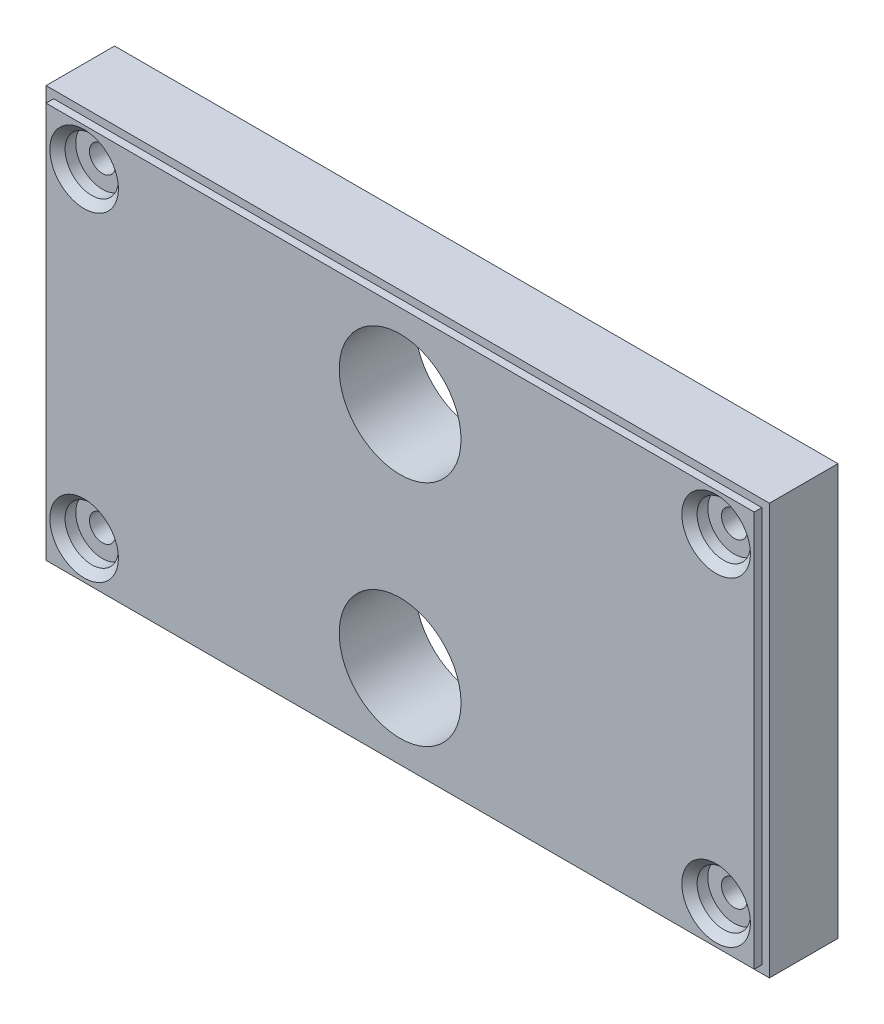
ISO-10303-21;
HEADER;
FILE_DESCRIPTION(('STEP AP214'),'2;1');
FILE_NAME('part.step','',(''),(''),'','','');
FILE_SCHEMA(('AUTOMOTIVE_DESIGN { 1 0 10303 214 1 1 1 1 }'));
ENDSEC;
DATA;
#1=APPLICATION_CONTEXT('core data for automotive mechanical design processes');
#2=APPLICATION_PROTOCOL_DEFINITION('international standard','automotive_design',2000,#1);
#3=PRODUCT_CONTEXT('',#1,'mechanical');
#4=PRODUCT('Part','Part','',(#3));
#5=PRODUCT_RELATED_PRODUCT_CATEGORY('part','',(#4));
#6=PRODUCT_DEFINITION_FORMATION('','',#4);
#7=PRODUCT_DEFINITION_CONTEXT('part definition',#1,'design');
#8=PRODUCT_DEFINITION('design','',#6,#7);
#9=PRODUCT_DEFINITION_SHAPE('','',#8);
#10=(LENGTH_UNIT() NAMED_UNIT(*) SI_UNIT(.MILLI.,.METRE.));
#11=(NAMED_UNIT(*) PLANE_ANGLE_UNIT() SI_UNIT($,.RADIAN.));
#12=(NAMED_UNIT(*) SI_UNIT($,.STERADIAN.) SOLID_ANGLE_UNIT());
#13=UNCERTAINTY_MEASURE_WITH_UNIT(LENGTH_MEASURE(1.E-05),#10,'distance_accuracy_value','');
#14=(GEOMETRIC_REPRESENTATION_CONTEXT(3) GLOBAL_UNCERTAINTY_ASSIGNED_CONTEXT((#13)) GLOBAL_UNIT_ASSIGNED_CONTEXT((#10,
#11,#12)) REPRESENTATION_CONTEXT('',''));
#15=CARTESIAN_POINT('',(0.,0.,0.));
#16=DIRECTION('',(0.,0.,1.));
#17=DIRECTION('',(1.,0.,0.));
#18=AXIS2_PLACEMENT_3D('',#15,#16,#17);
#19=CARTESIAN_POINT('',(-359.85170897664,-27.,119.27488274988));
#20=DIRECTION('',(-1.,0.,0.));
#21=DIRECTION('',(0.,0.,1.));
#22=AXIS2_PLACEMENT_3D('',#19,#20,#21);
#23=PLANE('',#22);
#24=DIRECTION('',(0.,1.,0.));
#25=VECTOR('',#24,1.);
#26=CARTESIAN_POINT('',(-359.85170897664,-27.,8.99999999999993));
#27=LINE('',#26,#25);
#28=CARTESIAN_POINT('',(-359.85170897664,-27.,8.99999999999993));
#29=VERTEX_POINT('',#28);
#30=CARTESIAN_POINT('',(-359.85170897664,27.,8.99999999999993));
#31=VERTEX_POINT('',#30);
#32=EDGE_CURVE('E79',#29,#31,#27,.T.);
#33=ORIENTED_EDGE('',*,*,#32,.F.);
#34=DIRECTION('',(0.,0.,-1.));
#35=VECTOR('',#34,1.);
#36=CARTESIAN_POINT('',(-359.85170897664,-27.,119.27488274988));
#37=LINE('',#36,#35);
#38=CARTESIAN_POINT('',(-359.85170897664,-27.,0.));
#39=VERTEX_POINT('',#38);
#40=EDGE_CURVE('E193',#29,#39,#37,.T.);
#41=ORIENTED_EDGE('',*,*,#40,.T.);
#42=DIRECTION('',(0.,1.,0.));
#43=VECTOR('',#42,1.);
#44=CARTESIAN_POINT('',(-359.85170897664,-27.,0.));
#45=LINE('',#44,#43);
#46=CARTESIAN_POINT('',(-359.85170897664,27.,0.));
#47=VERTEX_POINT('',#46);
#48=EDGE_CURVE('E188',#39,#47,#45,.T.);
#49=ORIENTED_EDGE('',*,*,#48,.T.);
#50=DIRECTION('',(0.,0.,-1.));
#51=VECTOR('',#50,1.);
#52=CARTESIAN_POINT('',(-359.85170897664,27.,119.27488274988));
#53=LINE('',#52,#51);
#54=EDGE_CURVE('E191',#31,#47,#53,.T.);
#55=ORIENTED_EDGE('',*,*,#54,.F.);
#56=EDGE_LOOP('',(#33,#41,#49,#55));
#57=FACE_BOUND('',#56,.T.);
#58=ADVANCED_FACE('F64',(#57),#23,.F.);
#59=CARTESIAN_POINT('',(-454.85170897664,-27.,119.27488274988));
#60=DIRECTION('',(0.,1.,0.));
#61=DIRECTION('',(0.,0.,1.));
#62=AXIS2_PLACEMENT_3D('',#59,#60,#61);
#63=PLANE('',#62);
#64=DIRECTION('',(1.,0.,0.));
#65=VECTOR('',#64,1.);
#66=CARTESIAN_POINT('',(-454.85170897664,-27.,8.99999999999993));
#67=LINE('',#66,#65);
#68=CARTESIAN_POINT('',(-454.85170897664,-27.,8.99999999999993));
#69=VERTEX_POINT('',#68);
#70=EDGE_CURVE('E176',#69,#29,#67,.T.);
#71=ORIENTED_EDGE('',*,*,#70,.F.);
#72=DIRECTION('',(0.,0.,-1.));
#73=VECTOR('',#72,1.);
#74=CARTESIAN_POINT('',(-454.85170897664,-27.,119.27488274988));
#75=LINE('',#74,#73);
#76=CARTESIAN_POINT('',(-454.85170897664,-27.,0.));
#77=VERTEX_POINT('',#76);
#78=EDGE_CURVE('E195',#69,#77,#75,.T.);
#79=ORIENTED_EDGE('',*,*,#78,.T.);
#80=DIRECTION('',(1.,0.,0.));
#81=VECTOR('',#80,1.);
#82=CARTESIAN_POINT('',(-454.85170897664,-27.,0.));
#83=LINE('',#82,#81);
#84=EDGE_CURVE('E185',#77,#39,#83,.T.);
#85=ORIENTED_EDGE('',*,*,#84,.T.);
#86=ORIENTED_EDGE('',*,*,#40,.F.);
#87=EDGE_LOOP('',(#71,#79,#85,#86));
#88=FACE_BOUND('',#87,.T.);
#89=ADVANCED_FACE('F237',(#88),#63,.F.);
#90=CARTESIAN_POINT('',(-454.85170897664,27.,119.27488274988));
#91=DIRECTION('',(1.,0.,0.));
#92=DIRECTION('',(0.,0.,-1.));
#93=AXIS2_PLACEMENT_3D('',#90,#91,#92);
#94=PLANE('',#93);
#95=DIRECTION('',(0.,-1.,0.));
#96=VECTOR('',#95,1.);
#97=CARTESIAN_POINT('',(-454.85170897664,27.,8.99999999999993));
#98=LINE('',#97,#96);
#99=CARTESIAN_POINT('',(-454.85170897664,27.,8.99999999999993));
#100=VERTEX_POINT('',#99);
#101=EDGE_CURVE('E174',#100,#69,#98,.T.);
#102=ORIENTED_EDGE('',*,*,#101,.F.);
#103=DIRECTION('',(0.,0.,-1.));
#104=VECTOR('',#103,1.);
#105=CARTESIAN_POINT('',(-454.85170897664,27.,119.27488274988));
#106=LINE('',#105,#104);
#107=CARTESIAN_POINT('',(-454.85170897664,27.,0.));
#108=VERTEX_POINT('',#107);
#109=EDGE_CURVE('E197',#100,#108,#106,.T.);
#110=ORIENTED_EDGE('',*,*,#109,.T.);
#111=DIRECTION('',(0.,-1.,0.));
#112=VECTOR('',#111,1.);
#113=CARTESIAN_POINT('',(-454.85170897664,27.,0.));
#114=LINE('',#113,#112);
#115=EDGE_CURVE('E182',#108,#77,#114,.T.);
#116=ORIENTED_EDGE('',*,*,#115,.T.);
#117=ORIENTED_EDGE('',*,*,#78,.F.);
#118=EDGE_LOOP('',(#102,#110,#116,#117));
#119=FACE_BOUND('',#118,.T.);
#120=ADVANCED_FACE('F243',(#119),#94,.F.);
#121=CARTESIAN_POINT('',(-359.85170897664,27.,119.27488274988));
#122=DIRECTION('',(0.,-1.,0.));
#123=DIRECTION('',(0.,0.,-1.));
#124=AXIS2_PLACEMENT_3D('',#121,#122,#123);
#125=PLANE('',#124);
#126=DIRECTION('',(-1.,0.,0.));
#127=VECTOR('',#126,1.);
#128=CARTESIAN_POINT('',(-359.85170897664,27.,8.99999999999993));
#129=LINE('',#128,#127);
#130=EDGE_CURVE('E169',#31,#100,#129,.T.);
#131=ORIENTED_EDGE('',*,*,#130,.F.);
#132=ORIENTED_EDGE('',*,*,#54,.T.);
#133=DIRECTION('',(-1.,0.,0.));
#134=VECTOR('',#133,1.);
#135=CARTESIAN_POINT('',(-359.85170897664,27.,0.));
#136=LINE('',#135,#134);
#137=EDGE_CURVE('E179',#47,#108,#136,.T.);
#138=ORIENTED_EDGE('',*,*,#137,.T.);
#139=ORIENTED_EDGE('',*,*,#109,.F.);
#140=EDGE_LOOP('',(#131,#132,#138,#139));
#141=FACE_BOUND('',#140,.T.);
#142=ADVANCED_FACE('F252',(#141),#125,.F.);
#143=CARTESIAN_POINT('',(0.,0.,0.));
#144=DIRECTION('',(0.,0.,1.));
#145=DIRECTION('',(1.,0.,0.));
#146=AXIS2_PLACEMENT_3D('',#143,#144,#145);
#147=PLANE('',#146);
#148=CARTESIAN_POINT('',(-407.35170897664,15.,0.));
#149=DIRECTION('',(0.,0.,1.));
#150=DIRECTION('',(1.,0.,0.));
#151=AXIS2_PLACEMENT_3D('',#148,#149,#150);
#152=CIRCLE('',#151,7.99999999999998);
#153=CARTESIAN_POINT('',(-399.35170897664,15.,0.));
#154=VERTEX_POINT('',#153);
#155=EDGE_CURVE('E338',#154,#154,#152,.T.);
#156=ORIENTED_EDGE('',*,*,#155,.T.);
#157=EDGE_LOOP('',(#156));
#158=FACE_BOUND('',#157,.T.);
#159=CARTESIAN_POINT('',(-407.35170897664,-15.,0.));
#160=DIRECTION('',(0.,0.,1.));
#161=DIRECTION('',(1.,0.,0.));
#162=AXIS2_PLACEMENT_3D('',#159,#160,#161);
#163=CIRCLE('',#162,7.99999999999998);
#164=CARTESIAN_POINT('',(-399.35170897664,-15.,0.));
#165=VERTEX_POINT('',#164);
#166=EDGE_CURVE('E342',#165,#165,#163,.T.);
#167=ORIENTED_EDGE('',*,*,#166,.T.);
#168=EDGE_LOOP('',(#167));
#169=FACE_BOUND('',#168,.T.);
#170=CARTESIAN_POINT('',(-448.85170897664,21.,0.));
#171=DIRECTION('',(0.,0.,1.));
#172=DIRECTION('',(1.,0.,0.));
#173=AXIS2_PLACEMENT_3D('',#170,#171,#172);
#174=CIRCLE('',#173,1.69999999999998);
#175=CARTESIAN_POINT('',(-447.15170897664,21.,0.));
#176=VERTEX_POINT('',#175);
#177=EDGE_CURVE('E346',#176,#176,#174,.T.);
#178=ORIENTED_EDGE('',*,*,#177,.T.);
#179=EDGE_LOOP('',(#178));
#180=FACE_BOUND('',#179,.T.);
#181=CARTESIAN_POINT('',(-365.85170897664,21.,0.));
#182=DIRECTION('',(0.,0.,1.));
#183=DIRECTION('',(1.,0.,0.));
#184=AXIS2_PLACEMENT_3D('',#181,#182,#183);
#185=CIRCLE('',#184,1.69999999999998);
#186=CARTESIAN_POINT('',(-364.15170897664,21.,0.));
#187=VERTEX_POINT('',#186);
#188=EDGE_CURVE('E279',#187,#187,#185,.T.);
#189=ORIENTED_EDGE('',*,*,#188,.T.);
#190=EDGE_LOOP('',(#189));
#191=FACE_BOUND('',#190,.T.);
#192=CARTESIAN_POINT('',(-365.85170897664,-21.,0.));
#193=DIRECTION('',(0.,0.,1.));
#194=DIRECTION('',(1.,0.,0.));
#195=AXIS2_PLACEMENT_3D('',#192,#193,#194);
#196=CIRCLE('',#195,1.69999999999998);
#197=CARTESIAN_POINT('',(-364.15170897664,-21.,0.));
#198=VERTEX_POINT('',#197);
#199=EDGE_CURVE('E282',#198,#198,#196,.T.);
#200=ORIENTED_EDGE('',*,*,#199,.T.);
#201=EDGE_LOOP('',(#200));
#202=FACE_BOUND('',#201,.T.);
#203=CARTESIAN_POINT('',(-448.85170897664,-21.,0.));
#204=DIRECTION('',(0.,0.,1.));
#205=DIRECTION('',(1.,0.,0.));
#206=AXIS2_PLACEMENT_3D('',#203,#204,#205);
#207=CIRCLE('',#206,1.69999999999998);
#208=CARTESIAN_POINT('',(-447.15170897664,-21.,0.));
#209=VERTEX_POINT('',#208);
#210=EDGE_CURVE('E159',#209,#209,#207,.T.);
#211=ORIENTED_EDGE('',*,*,#210,.T.);
#212=EDGE_LOOP('',(#211));
#213=FACE_BOUND('',#212,.T.);
#214=ORIENTED_EDGE('',*,*,#137,.F.);
#215=ORIENTED_EDGE('',*,*,#48,.F.);
#216=ORIENTED_EDGE('',*,*,#84,.F.);
#217=ORIENTED_EDGE('',*,*,#115,.F.);
#218=EDGE_LOOP('',(#214,#215,#216,#217));
#219=FACE_BOUND('',#218,.T.);
#220=ADVANCED_FACE('F247',(#158,#169,#180,#191,#202,#213,#219),#147,.F.);
#221=CARTESIAN_POINT('',(0.,0.,8.99999999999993));
#222=DIRECTION('',(0.,0.,1.));
#223=DIRECTION('',(1.,0.,0.));
#224=AXIS2_PLACEMENT_3D('',#221,#222,#223);
#225=PLANE('',#224);
#226=DIRECTION('',(0.,1.,0.));
#227=VECTOR('',#226,1.);
#228=CARTESIAN_POINT('',(-360.85170897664,-26.,8.99999999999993));
#229=LINE('',#228,#227);
#230=CARTESIAN_POINT('',(-360.85170897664,-26.,8.99999999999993));
#231=VERTEX_POINT('',#230);
#232=CARTESIAN_POINT('',(-360.85170897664,26.,8.99999999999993));
#233=VERTEX_POINT('',#232);
#234=EDGE_CURVE('E141',#231,#233,#229,.T.);
#235=ORIENTED_EDGE('',*,*,#234,.F.);
#236=DIRECTION('',(1.,0.,0.));
#237=VECTOR('',#236,1.);
#238=CARTESIAN_POINT('',(-453.85170897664,-26.,8.99999999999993));
#239=LINE('',#238,#237);
#240=CARTESIAN_POINT('',(-453.85170897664,-26.,8.99999999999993));
#241=VERTEX_POINT('',#240);
#242=EDGE_CURVE('E150',#241,#231,#239,.T.);
#243=ORIENTED_EDGE('',*,*,#242,.F.);
#244=DIRECTION('',(0.,-1.,0.));
#245=VECTOR('',#244,1.);
#246=CARTESIAN_POINT('',(-453.85170897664,26.,8.99999999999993));
#247=LINE('',#246,#245);
#248=CARTESIAN_POINT('',(-453.85170897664,26.,8.99999999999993));
#249=VERTEX_POINT('',#248);
#250=EDGE_CURVE('E133',#249,#241,#247,.T.);
#251=ORIENTED_EDGE('',*,*,#250,.F.);
#252=DIRECTION('',(-1.,0.,0.));
#253=VECTOR('',#252,1.);
#254=CARTESIAN_POINT('',(-360.85170897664,26.,8.99999999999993));
#255=LINE('',#254,#253);
#256=EDGE_CURVE('E147',#233,#249,#255,.T.);
#257=ORIENTED_EDGE('',*,*,#256,.F.);
#258=EDGE_LOOP('',(#235,#243,#251,#257));
#259=FACE_BOUND('',#258,.T.);
#260=ORIENTED_EDGE('',*,*,#130,.T.);
#261=ORIENTED_EDGE('',*,*,#101,.T.);
#262=ORIENTED_EDGE('',*,*,#70,.T.);
#263=ORIENTED_EDGE('',*,*,#32,.T.);
#264=EDGE_LOOP('',(#260,#261,#262,#263));
#265=FACE_BOUND('',#264,.T.);
#266=ADVANCED_FACE('F146',(#259,#265),#225,.T.);
#267=CARTESIAN_POINT('',(-360.85170897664,26.,8.99999999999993));
#268=DIRECTION('',(0.,1.,0.));
#269=DIRECTION('',(0.,0.,1.));
#270=AXIS2_PLACEMENT_3D('',#267,#268,#269);
#271=PLANE('',#270);
#272=DIRECTION('',(-1.,0.,0.));
#273=VECTOR('',#272,1.);
#274=CARTESIAN_POINT('',(-360.85170897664,26.,9.99999999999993));
#275=LINE('',#274,#273);
#276=CARTESIAN_POINT('',(-360.85170897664,26.,9.99999999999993));
#277=VERTEX_POINT('',#276);
#278=CARTESIAN_POINT('',(-453.85170897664,26.,9.99999999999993));
#279=VERTEX_POINT('',#278);
#280=EDGE_CURVE('E164',#277,#279,#275,.T.);
#281=ORIENTED_EDGE('',*,*,#280,.F.);
#282=DIRECTION('',(0.,0.,1.));
#283=VECTOR('',#282,1.);
#284=CARTESIAN_POINT('',(-360.85170897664,26.,8.99999999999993));
#285=LINE('',#284,#283);
#286=EDGE_CURVE('E153',#233,#277,#285,.T.);
#287=ORIENTED_EDGE('',*,*,#286,.F.);
#288=ORIENTED_EDGE('',*,*,#256,.T.);
#289=DIRECTION('',(0.,0.,1.));
#290=VECTOR('',#289,1.);
#291=CARTESIAN_POINT('',(-453.85170897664,26.,8.99999999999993));
#292=LINE('',#291,#290);
#293=EDGE_CURVE('E130',#249,#279,#292,.T.);
#294=ORIENTED_EDGE('',*,*,#293,.T.);
#295=EDGE_LOOP('',(#281,#287,#288,#294));
#296=FACE_BOUND('',#295,.T.);
#297=ADVANCED_FACE('F152',(#296),#271,.T.);
#298=CARTESIAN_POINT('',(-360.85170897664,-26.,8.99999999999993));
#299=DIRECTION('',(1.,0.,0.));
#300=DIRECTION('',(0.,0.,-1.));
#301=AXIS2_PLACEMENT_3D('',#298,#299,#300);
#302=PLANE('',#301);
#303=DIRECTION('',(0.,1.,0.));
#304=VECTOR('',#303,1.);
#305=CARTESIAN_POINT('',(-360.85170897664,-26.,9.99999999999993));
#306=LINE('',#305,#304);
#307=CARTESIAN_POINT('',(-360.85170897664,-26.,9.99999999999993));
#308=VERTEX_POINT('',#307);
#309=EDGE_CURVE('E154',#308,#277,#306,.T.);
#310=ORIENTED_EDGE('',*,*,#309,.F.);
#311=DIRECTION('',(0.,0.,1.));
#312=VECTOR('',#311,1.);
#313=CARTESIAN_POINT('',(-360.85170897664,-26.,8.99999999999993));
#314=LINE('',#313,#312);
#315=EDGE_CURVE('E170',#231,#308,#314,.T.);
#316=ORIENTED_EDGE('',*,*,#315,.F.);
#317=ORIENTED_EDGE('',*,*,#234,.T.);
#318=ORIENTED_EDGE('',*,*,#286,.T.);
#319=EDGE_LOOP('',(#310,#316,#317,#318));
#320=FACE_BOUND('',#319,.T.);
#321=ADVANCED_FACE('F317',(#320),#302,.T.);
#322=CARTESIAN_POINT('',(-453.85170897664,-26.,8.99999999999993));
#323=DIRECTION('',(0.,-1.,0.));
#324=DIRECTION('',(0.,0.,-1.));
#325=AXIS2_PLACEMENT_3D('',#322,#323,#324);
#326=PLANE('',#325);
#327=DIRECTION('',(1.,0.,0.));
#328=VECTOR('',#327,1.);
#329=CARTESIAN_POINT('',(-453.85170897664,-26.,9.99999999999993));
#330=LINE('',#329,#328);
#331=CARTESIAN_POINT('',(-453.85170897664,-26.,10.0000000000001));
#332=VERTEX_POINT('',#331);
#333=EDGE_CURVE('E87',#332,#308,#330,.T.);
#334=ORIENTED_EDGE('',*,*,#333,.F.);
#335=DIRECTION('',(0.,0.,1.));
#336=VECTOR('',#335,1.);
#337=CARTESIAN_POINT('',(-453.85170897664,-26.,8.99999999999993));
#338=LINE('',#337,#336);
#339=EDGE_CURVE('E140',#241,#332,#338,.T.);
#340=ORIENTED_EDGE('',*,*,#339,.F.);
#341=ORIENTED_EDGE('',*,*,#242,.T.);
#342=ORIENTED_EDGE('',*,*,#315,.T.);
#343=EDGE_LOOP('',(#334,#340,#341,#342));
#344=FACE_BOUND('',#343,.T.);
#345=ADVANCED_FACE('F320',(#344),#326,.T.);
#346=CARTESIAN_POINT('',(-453.85170897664,26.,8.99999999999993));
#347=DIRECTION('',(-1.,0.,0.));
#348=DIRECTION('',(0.,0.,1.));
#349=AXIS2_PLACEMENT_3D('',#346,#347,#348);
#350=PLANE('',#349);
#351=DIRECTION('',(0.,-1.,0.));
#352=VECTOR('',#351,1.);
#353=CARTESIAN_POINT('',(-453.85170897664,26.,9.99999999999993));
#354=LINE('',#353,#352);
#355=EDGE_CURVE('E135',#279,#332,#354,.T.);
#356=ORIENTED_EDGE('',*,*,#355,.F.);
#357=ORIENTED_EDGE('',*,*,#293,.F.);
#358=ORIENTED_EDGE('',*,*,#250,.T.);
#359=ORIENTED_EDGE('',*,*,#339,.T.);
#360=EDGE_LOOP('',(#356,#357,#358,#359));
#361=FACE_BOUND('',#360,.T.);
#362=ADVANCED_FACE('F132',(#361),#350,.T.);
#363=CARTESIAN_POINT('',(-349.851708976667,-50.,10.0000000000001));
#364=DIRECTION('',(0.,0.,-1.));
#365=DIRECTION('',(1.,0.,0.));
#366=AXIS2_PLACEMENT_3D('',#363,#364,#365);
#367=PLANE('',#366);
#368=CARTESIAN_POINT('',(-407.35170897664,15.,9.99999999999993));
#369=DIRECTION('',(0.,0.,1.));
#370=DIRECTION('',(1.,0.,0.));
#371=AXIS2_PLACEMENT_3D('',#368,#369,#370);
#372=CIRCLE('',#371,7.99999999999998);
#373=CARTESIAN_POINT('',(-399.35170897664,15.,9.99999999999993));
#374=VERTEX_POINT('',#373);
#375=EDGE_CURVE('E511',#374,#374,#372,.T.);
#376=ORIENTED_EDGE('',*,*,#375,.F.);
#377=EDGE_LOOP('',(#376));
#378=FACE_BOUND('',#377,.T.);
#379=CARTESIAN_POINT('',(-407.35170897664,-15.,9.99999999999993));
#380=DIRECTION('',(0.,0.,1.));
#381=DIRECTION('',(1.,0.,0.));
#382=AXIS2_PLACEMENT_3D('',#379,#380,#381);
#383=CIRCLE('',#382,7.99999999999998);
#384=CARTESIAN_POINT('',(-399.35170897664,-15.,9.99999999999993));
#385=VERTEX_POINT('',#384);
#386=EDGE_CURVE('E507',#385,#385,#383,.T.);
#387=ORIENTED_EDGE('',*,*,#386,.F.);
#388=EDGE_LOOP('',(#387));
#389=FACE_BOUND('',#388,.T.);
#390=CARTESIAN_POINT('',(-365.85170897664,-21.,10.0000000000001));
#391=DIRECTION('',(0.,0.,-1.));
#392=DIRECTION('',(-1.,0.,0.));
#393=AXIS2_PLACEMENT_3D('',#390,#391,#392);
#394=CIRCLE('',#393,4.50000000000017);
#395=CARTESIAN_POINT('',(-370.351708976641,-21.,10.0000000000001));
#396=VERTEX_POINT('',#395);
#397=EDGE_CURVE('E211',#396,#396,#394,.T.);
#398=ORIENTED_EDGE('',*,*,#397,.T.);
#399=EDGE_LOOP('',(#398));
#400=FACE_BOUND('',#399,.T.);
#401=CARTESIAN_POINT('',(-365.85170897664,21.,10.0000000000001));
#402=DIRECTION('',(0.,0.,-1.));
#403=DIRECTION('',(-1.,0.,0.));
#404=AXIS2_PLACEMENT_3D('',#401,#402,#403);
#405=CIRCLE('',#404,4.50000000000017);
#406=CARTESIAN_POINT('',(-370.351708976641,21.,10.0000000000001));
#407=VERTEX_POINT('',#406);
#408=EDGE_CURVE('E208',#407,#407,#405,.T.);
#409=ORIENTED_EDGE('',*,*,#408,.T.);
#410=EDGE_LOOP('',(#409));
#411=FACE_BOUND('',#410,.T.);
#412=CARTESIAN_POINT('',(-448.85170897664,21.,10.0000000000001));
#413=DIRECTION('',(0.,0.,-1.));
#414=DIRECTION('',(-1.,0.,0.));
#415=AXIS2_PLACEMENT_3D('',#412,#413,#414);
#416=CIRCLE('',#415,4.50000000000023);
#417=CARTESIAN_POINT('',(-453.351708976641,21.,10.0000000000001));
#418=VERTEX_POINT('',#417);
#419=EDGE_CURVE('E205',#418,#418,#416,.T.);
#420=ORIENTED_EDGE('',*,*,#419,.T.);
#421=EDGE_LOOP('',(#420));
#422=FACE_BOUND('',#421,.T.);
#423=CARTESIAN_POINT('',(-448.85170897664,-21.,10.0000000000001));
#424=DIRECTION('',(0.,0.,-1.));
#425=DIRECTION('',(-1.,0.,0.));
#426=AXIS2_PLACEMENT_3D('',#423,#424,#425);
#427=CIRCLE('',#426,4.50000000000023);
#428=CARTESIAN_POINT('',(-453.351708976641,-21.,10.0000000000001));
#429=VERTEX_POINT('',#428);
#430=EDGE_CURVE('E202',#429,#429,#427,.T.);
#431=ORIENTED_EDGE('',*,*,#430,.T.);
#432=EDGE_LOOP('',(#431));
#433=FACE_BOUND('',#432,.T.);
#434=ORIENTED_EDGE('',*,*,#280,.T.);
#435=ORIENTED_EDGE('',*,*,#355,.T.);
#436=ORIENTED_EDGE('',*,*,#333,.T.);
#437=ORIENTED_EDGE('',*,*,#309,.T.);
#438=EDGE_LOOP('',(#434,#435,#436,#437));
#439=FACE_BOUND('',#438,.T.);
#440=ADVANCED_FACE('F305',(#378,#389,#400,#411,#422,#433,#439),#367,.F.);
#441=CARTESIAN_POINT('',(-448.85170897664,-21.,9.99999999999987));
#442=DIRECTION('',(0.,0.,1.));
#443=DIRECTION('',(1.,0.,0.));
#444=AXIS2_PLACEMENT_3D('',#441,#442,#443);
#445=CYLINDRICAL_SURFACE('',#444,1.69999999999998);
#446=ORIENTED_EDGE('',*,*,#210,.F.);
#447=EDGE_LOOP('',(#446));
#448=FACE_BOUND('',#447,.T.);
#449=CARTESIAN_POINT('',(-448.85170897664,-21.,7.59999999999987));
#450=DIRECTION('',(0.,0.,1.));
#451=DIRECTION('',(1.,0.,0.));
#452=AXIS2_PLACEMENT_3D('',#449,#450,#451);
#453=CIRCLE('',#452,1.69999999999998);
#454=CARTESIAN_POINT('',(-447.15170897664,-21.,7.59999999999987));
#455=VERTEX_POINT('',#454);
#456=EDGE_CURVE('E293',#455,#455,#453,.T.);
#457=ORIENTED_EDGE('',*,*,#456,.T.);
#458=EDGE_LOOP('',(#457));
#459=FACE_BOUND('',#458,.T.);
#460=ADVANCED_FACE('F302',(#448,#459),#445,.F.);
#461=CARTESIAN_POINT('',(-447.15170897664,-21.,7.59999999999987));
#462=DIRECTION('',(0.,0.,-1.));
#463=DIRECTION('',(-1.,0.,0.));
#464=AXIS2_PLACEMENT_3D('',#461,#462,#463);
#465=PLANE('',#464);
#466=ORIENTED_EDGE('',*,*,#456,.F.);
#467=EDGE_LOOP('',(#466));
#468=FACE_BOUND('',#467,.T.);
#469=CARTESIAN_POINT('',(-448.85170897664,-21.,7.59999999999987));
#470=DIRECTION('',(0.,0.,1.));
#471=DIRECTION('',(1.,0.,0.));
#472=AXIS2_PLACEMENT_3D('',#469,#470,#471);
#473=CIRCLE('',#472,3.5);
#474=CARTESIAN_POINT('',(-445.35170897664,-21.,7.59999999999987));
#475=VERTEX_POINT('',#474);
#476=EDGE_CURVE('E291',#475,#475,#473,.T.);
#477=ORIENTED_EDGE('',*,*,#476,.T.);
#478=EDGE_LOOP('',(#477));
#479=FACE_BOUND('',#478,.T.);
#480=ADVANCED_FACE('F304',(#468,#479),#465,.F.);
#481=CARTESIAN_POINT('',(-448.85170897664,-21.,9.99999999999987));
#482=DIRECTION('',(0.,0.,1.));
#483=DIRECTION('',(1.,0.,0.));
#484=AXIS2_PLACEMENT_3D('',#481,#482,#483);
#485=CYLINDRICAL_SURFACE('',#484,3.5);
#486=CARTESIAN_POINT('',(-448.85170897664,-21.,8.9999999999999));
#487=DIRECTION('',(0.,0.,-1.));
#488=DIRECTION('',(-1.,0.,0.));
#489=AXIS2_PLACEMENT_3D('',#486,#487,#488);
#490=CIRCLE('',#489,3.5);
#491=CARTESIAN_POINT('',(-452.35170897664,-21.,8.9999999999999));
#492=VERTEX_POINT('',#491);
#493=EDGE_CURVE('E12',#492,#492,#490,.F.);
#494=ORIENTED_EDGE('',*,*,#493,.T.);
#495=EDGE_LOOP('',(#494));
#496=FACE_BOUND('',#495,.T.);
#497=ORIENTED_EDGE('',*,*,#476,.F.);
#498=EDGE_LOOP('',(#497));
#499=FACE_BOUND('',#498,.T.);
#500=ADVANCED_FACE('F311',(#496,#499),#485,.F.);
#501=CARTESIAN_POINT('',(-365.85170897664,-21.,9.99999999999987));
#502=DIRECTION('',(0.,0.,1.));
#503=DIRECTION('',(1.,0.,0.));
#504=AXIS2_PLACEMENT_3D('',#501,#502,#503);
#505=CYLINDRICAL_SURFACE('',#504,1.69999999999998);
#506=ORIENTED_EDGE('',*,*,#199,.F.);
#507=EDGE_LOOP('',(#506));
#508=FACE_BOUND('',#507,.T.);
#509=CARTESIAN_POINT('',(-365.85170897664,-21.,7.59999999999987));
#510=DIRECTION('',(0.,0.,1.));
#511=DIRECTION('',(1.,0.,0.));
#512=AXIS2_PLACEMENT_3D('',#509,#510,#511);
#513=CIRCLE('',#512,1.69999999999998);
#514=CARTESIAN_POINT('',(-364.15170897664,-21.,7.59999999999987));
#515=VERTEX_POINT('',#514);
#516=EDGE_CURVE('E278',#515,#515,#513,.T.);
#517=ORIENTED_EDGE('',*,*,#516,.T.);
#518=EDGE_LOOP('',(#517));
#519=FACE_BOUND('',#518,.T.);
#520=ADVANCED_FACE('F351',(#508,#519),#505,.F.);
#521=CARTESIAN_POINT('',(-364.15170897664,-21.,7.59999999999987));
#522=DIRECTION('',(0.,0.,-1.));
#523=DIRECTION('',(-1.,0.,0.));
#524=AXIS2_PLACEMENT_3D('',#521,#522,#523);
#525=PLANE('',#524);
#526=ORIENTED_EDGE('',*,*,#516,.F.);
#527=EDGE_LOOP('',(#526));
#528=FACE_BOUND('',#527,.T.);
#529=CARTESIAN_POINT('',(-365.85170897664,-21.,7.59999999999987));
#530=DIRECTION('',(0.,0.,1.));
#531=DIRECTION('',(1.,0.,0.));
#532=AXIS2_PLACEMENT_3D('',#529,#530,#531);
#533=CIRCLE('',#532,3.5);
#534=CARTESIAN_POINT('',(-362.35170897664,-21.,7.59999999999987));
#535=VERTEX_POINT('',#534);
#536=EDGE_CURVE('E276',#535,#535,#533,.T.);
#537=ORIENTED_EDGE('',*,*,#536,.T.);
#538=EDGE_LOOP('',(#537));
#539=FACE_BOUND('',#538,.T.);
#540=ADVANCED_FACE('F272',(#528,#539),#525,.F.);
#541=CARTESIAN_POINT('',(-365.85170897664,-21.,9.99999999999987));
#542=DIRECTION('',(0.,0.,1.));
#543=DIRECTION('',(1.,0.,0.));
#544=AXIS2_PLACEMENT_3D('',#541,#542,#543);
#545=CYLINDRICAL_SURFACE('',#544,3.5);
#546=CARTESIAN_POINT('',(-365.85170897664,-21.,8.99999999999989));
#547=DIRECTION('',(0.,0.,-1.));
#548=DIRECTION('',(-1.,0.,0.));
#549=AXIS2_PLACEMENT_3D('',#546,#547,#548);
#550=CIRCLE('',#549,3.5);
#551=CARTESIAN_POINT('',(-369.35170897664,-21.,8.99999999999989));
#552=VERTEX_POINT('',#551);
#553=EDGE_CURVE('E199',#552,#552,#550,.F.);
#554=ORIENTED_EDGE('',*,*,#553,.T.);
#555=EDGE_LOOP('',(#554));
#556=FACE_BOUND('',#555,.T.);
#557=ORIENTED_EDGE('',*,*,#536,.F.);
#558=EDGE_LOOP('',(#557));
#559=FACE_BOUND('',#558,.T.);
#560=ADVANCED_FACE('F268',(#556,#559),#545,.F.);
#561=CARTESIAN_POINT('',(-365.85170897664,21.,9.99999999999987));
#562=DIRECTION('',(0.,0.,1.));
#563=DIRECTION('',(1.,0.,0.));
#564=AXIS2_PLACEMENT_3D('',#561,#562,#563);
#565=CYLINDRICAL_SURFACE('',#564,1.69999999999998);
#566=ORIENTED_EDGE('',*,*,#188,.F.);
#567=EDGE_LOOP('',(#566));
#568=FACE_BOUND('',#567,.T.);
#569=CARTESIAN_POINT('',(-365.85170897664,21.,7.59999999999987));
#570=DIRECTION('',(0.,0.,1.));
#571=DIRECTION('',(1.,0.,0.));
#572=AXIS2_PLACEMENT_3D('',#569,#570,#571);
#573=CIRCLE('',#572,1.69999999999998);
#574=CARTESIAN_POINT('',(-364.15170897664,21.,7.59999999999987));
#575=VERTEX_POINT('',#574);
#576=EDGE_CURVE('E285',#575,#575,#573,.T.);
#577=ORIENTED_EDGE('',*,*,#576,.T.);
#578=EDGE_LOOP('',(#577));
#579=FACE_BOUND('',#578,.T.);
#580=ADVANCED_FACE('F271',(#568,#579),#565,.F.);
#581=CARTESIAN_POINT('',(-364.15170897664,21.,7.59999999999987));
#582=DIRECTION('',(0.,0.,-1.));
#583=DIRECTION('',(-1.,0.,0.));
#584=AXIS2_PLACEMENT_3D('',#581,#582,#583);
#585=PLANE('',#584);
#586=ORIENTED_EDGE('',*,*,#576,.F.);
#587=EDGE_LOOP('',(#586));
#588=FACE_BOUND('',#587,.T.);
#589=CARTESIAN_POINT('',(-365.85170897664,21.,7.59999999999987));
#590=DIRECTION('',(0.,0.,1.));
#591=DIRECTION('',(1.,0.,0.));
#592=AXIS2_PLACEMENT_3D('',#589,#590,#591);
#593=CIRCLE('',#592,3.5);
#594=CARTESIAN_POINT('',(-362.35170897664,21.,7.59999999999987));
#595=VERTEX_POINT('',#594);
#596=EDGE_CURVE('E495',#595,#595,#593,.T.);
#597=ORIENTED_EDGE('',*,*,#596,.T.);
#598=EDGE_LOOP('',(#597));
#599=FACE_BOUND('',#598,.T.);
#600=ADVANCED_FACE('F395',(#588,#599),#585,.F.);
#601=CARTESIAN_POINT('',(-365.85170897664,21.,9.99999999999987));
#602=DIRECTION('',(0.,0.,1.));
#603=DIRECTION('',(1.,0.,0.));
#604=AXIS2_PLACEMENT_3D('',#601,#602,#603);
#605=CYLINDRICAL_SURFACE('',#604,3.5);
#606=CARTESIAN_POINT('',(-365.85170897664,21.,8.99999999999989));
#607=DIRECTION('',(0.,0.,-1.));
#608=DIRECTION('',(-1.,0.,0.));
#609=AXIS2_PLACEMENT_3D('',#606,#607,#608);
#610=CIRCLE('',#609,3.5);
#611=CARTESIAN_POINT('',(-369.35170897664,21.,8.99999999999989));
#612=VERTEX_POINT('',#611);
#613=EDGE_CURVE('E214',#612,#612,#610,.F.);
#614=ORIENTED_EDGE('',*,*,#613,.T.);
#615=EDGE_LOOP('',(#614));
#616=FACE_BOUND('',#615,.T.);
#617=ORIENTED_EDGE('',*,*,#596,.F.);
#618=EDGE_LOOP('',(#617));
#619=FACE_BOUND('',#618,.T.);
#620=ADVANCED_FACE('F404',(#616,#619),#605,.F.);
#621=CARTESIAN_POINT('',(-448.85170897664,21.,9.99999999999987));
#622=DIRECTION('',(0.,0.,1.));
#623=DIRECTION('',(1.,0.,0.));
#624=AXIS2_PLACEMENT_3D('',#621,#622,#623);
#625=CYLINDRICAL_SURFACE('',#624,1.69999999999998);
#626=ORIENTED_EDGE('',*,*,#177,.F.);
#627=EDGE_LOOP('',(#626));
#628=FACE_BOUND('',#627,.T.);
#629=CARTESIAN_POINT('',(-448.85170897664,21.,7.59999999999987));
#630=DIRECTION('',(0.,0.,1.));
#631=DIRECTION('',(1.,0.,0.));
#632=AXIS2_PLACEMENT_3D('',#629,#630,#631);
#633=CIRCLE('',#632,1.69999999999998);
#634=CARTESIAN_POINT('',(-447.15170897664,21.,7.59999999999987));
#635=VERTEX_POINT('',#634);
#636=EDGE_CURVE('E499',#635,#635,#633,.T.);
#637=ORIENTED_EDGE('',*,*,#636,.T.);
#638=EDGE_LOOP('',(#637));
#639=FACE_BOUND('',#638,.T.);
#640=ADVANCED_FACE('F412',(#628,#639),#625,.F.);
#641=CARTESIAN_POINT('',(-447.15170897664,21.,7.59999999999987));
#642=DIRECTION('',(0.,0.,-1.));
#643=DIRECTION('',(-1.,0.,0.));
#644=AXIS2_PLACEMENT_3D('',#641,#642,#643);
#645=PLANE('',#644);
#646=ORIENTED_EDGE('',*,*,#636,.F.);
#647=EDGE_LOOP('',(#646));
#648=FACE_BOUND('',#647,.T.);
#649=CARTESIAN_POINT('',(-448.85170897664,21.,7.59999999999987));
#650=DIRECTION('',(0.,0.,1.));
#651=DIRECTION('',(1.,0.,0.));
#652=AXIS2_PLACEMENT_3D('',#649,#650,#651);
#653=CIRCLE('',#652,3.5);
#654=CARTESIAN_POINT('',(-445.35170897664,21.,7.59999999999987));
#655=VERTEX_POINT('',#654);
#656=EDGE_CURVE('E504',#655,#655,#653,.T.);
#657=ORIENTED_EDGE('',*,*,#656,.T.);
#658=EDGE_LOOP('',(#657));
#659=FACE_BOUND('',#658,.T.);
#660=ADVANCED_FACE('F262',(#648,#659),#645,.F.);
#661=CARTESIAN_POINT('',(-448.85170897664,21.,9.99999999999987));
#662=DIRECTION('',(0.,0.,1.));
#663=DIRECTION('',(1.,0.,0.));
#664=AXIS2_PLACEMENT_3D('',#661,#662,#663);
#665=CYLINDRICAL_SURFACE('',#664,3.5);
#666=CARTESIAN_POINT('',(-448.85170897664,21.,8.9999999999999));
#667=DIRECTION('',(0.,0.,-1.));
#668=DIRECTION('',(-1.,0.,0.));
#669=AXIS2_PLACEMENT_3D('',#666,#667,#668);
#670=CIRCLE('',#669,3.5);
#671=CARTESIAN_POINT('',(-452.35170897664,21.,8.9999999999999));
#672=VERTEX_POINT('',#671);
#673=EDGE_CURVE('E72',#672,#672,#670,.F.);
#674=ORIENTED_EDGE('',*,*,#673,.T.);
#675=EDGE_LOOP('',(#674));
#676=FACE_BOUND('',#675,.T.);
#677=ORIENTED_EDGE('',*,*,#656,.F.);
#678=EDGE_LOOP('',(#677));
#679=FACE_BOUND('',#678,.T.);
#680=ADVANCED_FACE('F219',(#676,#679),#665,.F.);
#681=CARTESIAN_POINT('',(-365.85170897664,-21.,8.99999999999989));
#682=DIRECTION('',(0.,0.,1.));
#683=DIRECTION('',(1.,0.,0.));
#684=AXIS2_PLACEMENT_3D('',#681,#682,#683);
#685=CONICAL_SURFACE('',#684,3.5,0.785398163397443);
#686=ORIENTED_EDGE('',*,*,#397,.F.);
#687=EDGE_LOOP('',(#686));
#688=FACE_BOUND('',#687,.T.);
#689=ORIENTED_EDGE('',*,*,#553,.F.);
#690=EDGE_LOOP('',(#689));
#691=FACE_BOUND('',#690,.T.);
#692=ADVANCED_FACE('F232',(#688,#691),#685,.F.);
#693=CARTESIAN_POINT('',(-365.85170897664,21.,8.99999999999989));
#694=DIRECTION('',(0.,0.,1.));
#695=DIRECTION('',(1.,0.,0.));
#696=AXIS2_PLACEMENT_3D('',#693,#694,#695);
#697=CONICAL_SURFACE('',#696,3.5,0.785398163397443);
#698=ORIENTED_EDGE('',*,*,#408,.F.);
#699=EDGE_LOOP('',(#698));
#700=FACE_BOUND('',#699,.T.);
#701=ORIENTED_EDGE('',*,*,#613,.F.);
#702=EDGE_LOOP('',(#701));
#703=FACE_BOUND('',#702,.T.);
#704=ADVANCED_FACE('F224',(#700,#703),#697,.F.);
#705=CARTESIAN_POINT('',(-448.85170897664,21.,8.9999999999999));
#706=DIRECTION('',(0.,0.,1.));
#707=DIRECTION('',(1.,0.,0.));
#708=AXIS2_PLACEMENT_3D('',#705,#706,#707);
#709=CONICAL_SURFACE('',#708,3.5,0.785398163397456);
#710=ORIENTED_EDGE('',*,*,#419,.F.);
#711=EDGE_LOOP('',(#710));
#712=FACE_BOUND('',#711,.T.);
#713=ORIENTED_EDGE('',*,*,#673,.F.);
#714=EDGE_LOOP('',(#713));
#715=FACE_BOUND('',#714,.T.);
#716=ADVANCED_FACE('F222',(#712,#715),#709,.F.);
#717=CARTESIAN_POINT('',(-448.85170897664,-21.,8.9999999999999));
#718=DIRECTION('',(0.,0.,1.));
#719=DIRECTION('',(1.,0.,0.));
#720=AXIS2_PLACEMENT_3D('',#717,#718,#719);
#721=CONICAL_SURFACE('',#720,3.5,0.785398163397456);
#722=ORIENTED_EDGE('',*,*,#430,.F.);
#723=EDGE_LOOP('',(#722));
#724=FACE_BOUND('',#723,.T.);
#725=ORIENTED_EDGE('',*,*,#493,.F.);
#726=EDGE_LOOP('',(#725));
#727=FACE_BOUND('',#726,.T.);
#728=ADVANCED_FACE('F66',(#724,#727),#721,.F.);
#729=CARTESIAN_POINT('',(-407.35170897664,-15.,0.));
#730=DIRECTION('',(0.,0.,1.));
#731=DIRECTION('',(1.,0.,0.));
#732=AXIS2_PLACEMENT_3D('',#729,#730,#731);
#733=CYLINDRICAL_SURFACE('',#732,7.99999999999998);
#734=ORIENTED_EDGE('',*,*,#166,.F.);
#735=EDGE_LOOP('',(#734));
#736=FACE_BOUND('',#735,.T.);
#737=ORIENTED_EDGE('',*,*,#386,.T.);
#738=EDGE_LOOP('',(#737));
#739=FACE_BOUND('',#738,.T.);
#740=ADVANCED_FACE('F230',(#736,#739),#733,.F.);
#741=CARTESIAN_POINT('',(-407.35170897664,15.,0.));
#742=DIRECTION('',(0.,0.,1.));
#743=DIRECTION('',(1.,0.,0.));
#744=AXIS2_PLACEMENT_3D('',#741,#742,#743);
#745=CYLINDRICAL_SURFACE('',#744,7.99999999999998);
#746=ORIENTED_EDGE('',*,*,#155,.F.);
#747=EDGE_LOOP('',(#746));
#748=FACE_BOUND('',#747,.T.);
#749=ORIENTED_EDGE('',*,*,#375,.T.);
#750=EDGE_LOOP('',(#749));
#751=FACE_BOUND('',#750,.T.);
#752=ADVANCED_FACE('F473',(#748,#751),#745,.F.);
#753=CLOSED_SHELL('',(#58,#89,#120,#142,#220,#266,#297,#321,#345,#362,#440,#460,#480,#500,#520,
#540,#560,#580,#600,#620,#640,#660,#680,#692,#704,#716,#728,#740,#752));
#754=MANIFOLD_SOLID_BREP('B2',#753);
#755=ADVANCED_BREP_SHAPE_REPRESENTATION('',(#18,#754),#14);
#756=SHAPE_DEFINITION_REPRESENTATION(#9,#755);
ENDSEC;
END-ISO-10303-21;
